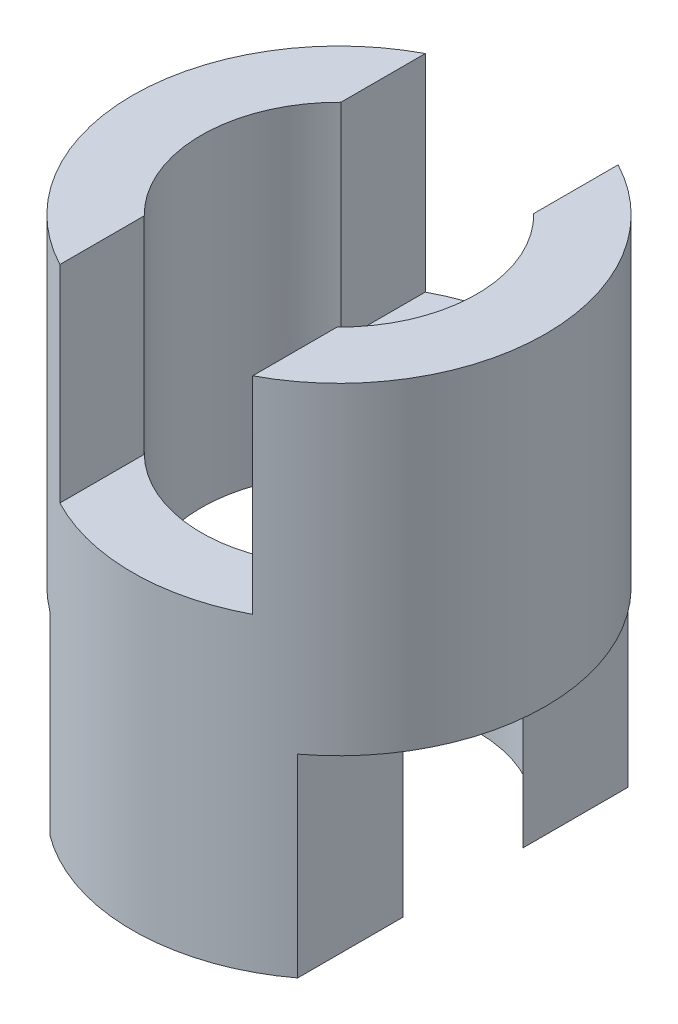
ISO-10303-21;
HEADER;
FILE_DESCRIPTION(('STEP AP214'),'2;1');
FILE_NAME('part.step','',(''),(''),'','','');
FILE_SCHEMA(('AUTOMOTIVE_DESIGN { 1 0 10303 214 1 1 1 1 }'));
ENDSEC;
DATA;
#1=APPLICATION_CONTEXT('core data for automotive mechanical design processes');
#2=APPLICATION_PROTOCOL_DEFINITION('international standard','automotive_design',2000,#1);
#3=PRODUCT_CONTEXT('',#1,'mechanical');
#4=PRODUCT('Part','Part','',(#3));
#5=PRODUCT_RELATED_PRODUCT_CATEGORY('part','',(#4));
#6=PRODUCT_DEFINITION_FORMATION('','',#4);
#7=PRODUCT_DEFINITION_CONTEXT('part definition',#1,'design');
#8=PRODUCT_DEFINITION('design','',#6,#7);
#9=PRODUCT_DEFINITION_SHAPE('','',#8);
#10=(LENGTH_UNIT() NAMED_UNIT(*) SI_UNIT(.MILLI.,.METRE.));
#11=(NAMED_UNIT(*) PLANE_ANGLE_UNIT() SI_UNIT($,.RADIAN.));
#12=(NAMED_UNIT(*) SI_UNIT($,.STERADIAN.) SOLID_ANGLE_UNIT());
#13=UNCERTAINTY_MEASURE_WITH_UNIT(LENGTH_MEASURE(1.E-05),#10,'distance_accuracy_value','');
#14=(GEOMETRIC_REPRESENTATION_CONTEXT(3) GLOBAL_UNCERTAINTY_ASSIGNED_CONTEXT((#13)) GLOBAL_UNIT_ASSIGNED_CONTEXT((#10,
#11,#12)) REPRESENTATION_CONTEXT('',''));
#15=CARTESIAN_POINT('',(0.,0.,0.));
#16=DIRECTION('',(0.,0.,1.));
#17=DIRECTION('',(1.,0.,0.));
#18=AXIS2_PLACEMENT_3D('',#15,#16,#17);
#19=CARTESIAN_POINT('',(0.,0.,0.));
#20=DIRECTION('',(0.,1.,0.));
#21=DIRECTION('',(0.,0.,1.));
#22=AXIS2_PLACEMENT_3D('',#19,#20,#21);
#23=PLANE('',#22);
#24=CARTESIAN_POINT('',(0.,0.,0.));
#25=DIRECTION('',(0.,1.,0.));
#26=DIRECTION('',(0.,0.,1.));
#27=AXIS2_PLACEMENT_3D('',#24,#25,#26);
#28=CIRCLE('',#27,30.);
#29=CARTESIAN_POINT('',(18.,0.,-24.));
#30=VERTEX_POINT('',#29);
#31=CARTESIAN_POINT('',(-18.,0.,-24.));
#32=VERTEX_POINT('',#31);
#33=EDGE_CURVE('E221',#30,#32,#28,.T.);
#34=ORIENTED_EDGE('',*,*,#33,.F.);
#35=DIRECTION('',(0.,0.,1.));
#36=VECTOR('',#35,1.);
#37=CARTESIAN_POINT('',(18.,0.,0.));
#38=LINE('',#37,#36);
#39=CARTESIAN_POINT('',(18.,0.,-8.71779788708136));
#40=VERTEX_POINT('',#39);
#41=EDGE_CURVE('E150',#30,#40,#38,.T.);
#42=ORIENTED_EDGE('',*,*,#41,.T.);
#43=CARTESIAN_POINT('',(0.,0.,0.));
#44=DIRECTION('',(0.,-1.,0.));
#45=DIRECTION('',(0.,0.,-1.));
#46=AXIS2_PLACEMENT_3D('',#43,#44,#45);
#47=CIRCLE('',#46,20.);
#48=CARTESIAN_POINT('',(-18.,0.,-8.71779788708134));
#49=VERTEX_POINT('',#48);
#50=EDGE_CURVE('E190',#49,#40,#47,.T.);
#51=ORIENTED_EDGE('',*,*,#50,.F.);
#52=DIRECTION('',(0.,0.,-1.));
#53=VECTOR('',#52,1.);
#54=CARTESIAN_POINT('',(-18.,0.,0.));
#55=LINE('',#54,#53);
#56=EDGE_CURVE('E54',#49,#32,#55,.T.);
#57=ORIENTED_EDGE('',*,*,#56,.T.);
#58=EDGE_LOOP('',(#34,#42,#51,#57));
#59=FACE_BOUND('',#58,.T.);
#60=ADVANCED_FACE('F31',(#59),#23,.F.);
#61=CARTESIAN_POINT('',(-14.,45.,52.1788235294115));
#62=DIRECTION('',(0.,1.,0.));
#63=DIRECTION('',(0.,0.,1.));
#64=AXIS2_PLACEMENT_3D('',#61,#62,#63);
#65=PLANE('',#64);
#66=CARTESIAN_POINT('',(0.,45.,0.));
#67=DIRECTION('',(0.,1.,0.));
#68=DIRECTION('',(0.,0.,1.));
#69=AXIS2_PLACEMENT_3D('',#66,#67,#68);
#70=CIRCLE('',#69,20.);
#71=CARTESIAN_POINT('',(14.,45.,-14.2828568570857));
#72=VERTEX_POINT('',#71);
#73=CARTESIAN_POINT('',(-14.,45.,-14.2828568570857));
#74=VERTEX_POINT('',#73);
#75=EDGE_CURVE('E188',#72,#74,#70,.T.);
#76=ORIENTED_EDGE('',*,*,#75,.F.);
#77=DIRECTION('',(0.,0.,-1.));
#78=VECTOR('',#77,1.);
#79=CARTESIAN_POINT('',(14.,45.,-47.2950912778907));
#80=LINE('',#79,#78);
#81=CARTESIAN_POINT('',(14.,45.,-26.5329983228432));
#82=VERTEX_POINT('',#81);
#83=EDGE_CURVE('E205',#72,#82,#80,.T.);
#84=ORIENTED_EDGE('',*,*,#83,.T.);
#85=CARTESIAN_POINT('',(0.,45.,0.));
#86=DIRECTION('',(0.,1.,0.));
#87=DIRECTION('',(0.,0.,1.));
#88=AXIS2_PLACEMENT_3D('',#85,#86,#87);
#89=CIRCLE('',#88,30.);
#90=CARTESIAN_POINT('',(-14.,45.,-26.5329983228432));
#91=VERTEX_POINT('',#90);
#92=EDGE_CURVE('E238',#82,#91,#89,.T.);
#93=ORIENTED_EDGE('',*,*,#92,.T.);
#94=DIRECTION('',(0.,0.,1.));
#95=VECTOR('',#94,1.);
#96=CARTESIAN_POINT('',(-14.,45.,-47.2950912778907));
#97=LINE('',#96,#95);
#98=EDGE_CURVE('E202',#91,#74,#97,.T.);
#99=ORIENTED_EDGE('',*,*,#98,.T.);
#100=EDGE_LOOP('',(#76,#84,#93,#99));
#101=FACE_BOUND('',#100,.T.);
#102=ADVANCED_FACE('F275',(#101),#65,.T.);
#103=CARTESIAN_POINT('',(-14.,45.,-47.2950912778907));
#104=DIRECTION('',(-1.,0.,0.));
#105=DIRECTION('',(0.,0.,1.));
#106=AXIS2_PLACEMENT_3D('',#103,#104,#105);
#107=PLANE('',#106);
#108=DIRECTION('',(0.,0.,1.));
#109=VECTOR('',#108,1.);
#110=CARTESIAN_POINT('',(-14.,75.,0.));
#111=LINE('',#110,#109);
#112=CARTESIAN_POINT('',(-14.,75.,-26.5329983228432));
#113=VERTEX_POINT('',#112);
#114=CARTESIAN_POINT('',(-14.,75.,-14.2828568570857));
#115=VERTEX_POINT('',#114);
#116=EDGE_CURVE('E233',#113,#115,#111,.T.);
#117=ORIENTED_EDGE('',*,*,#116,.T.);
#118=DIRECTION('',(0.,-1.,0.));
#119=VECTOR('',#118,1.);
#120=CARTESIAN_POINT('',(-14.,75.,-14.2828568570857));
#121=LINE('',#120,#119);
#122=EDGE_CURVE('E194',#115,#74,#121,.T.);
#123=ORIENTED_EDGE('',*,*,#122,.T.);
#124=ORIENTED_EDGE('',*,*,#98,.F.);
#125=DIRECTION('',(0.,-1.,0.));
#126=VECTOR('',#125,1.);
#127=CARTESIAN_POINT('',(-14.,75.,-26.5329983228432));
#128=LINE('',#127,#126);
#129=EDGE_CURVE('E218',#113,#91,#128,.T.);
#130=ORIENTED_EDGE('',*,*,#129,.F.);
#131=EDGE_LOOP('',(#117,#123,#124,#130));
#132=FACE_BOUND('',#131,.T.);
#133=ADVANCED_FACE('F279',(#132),#107,.F.);
#134=CARTESIAN_POINT('',(14.,45.,-47.2950912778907));
#135=DIRECTION('',(1.,0.,0.));
#136=DIRECTION('',(0.,0.,-1.));
#137=AXIS2_PLACEMENT_3D('',#134,#135,#136);
#138=PLANE('',#137);
#139=DIRECTION('',(0.,0.,-1.));
#140=VECTOR('',#139,1.);
#141=CARTESIAN_POINT('',(14.,75.,0.));
#142=LINE('',#141,#140);
#143=CARTESIAN_POINT('',(14.,75.,26.5329983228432));
#144=VERTEX_POINT('',#143);
#145=CARTESIAN_POINT('',(14.,75.,14.2828568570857));
#146=VERTEX_POINT('',#145);
#147=EDGE_CURVE('E229',#144,#146,#142,.T.);
#148=ORIENTED_EDGE('',*,*,#147,.T.);
#149=DIRECTION('',(0.,-1.,0.));
#150=VECTOR('',#149,1.);
#151=CARTESIAN_POINT('',(14.,75.,14.2828568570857));
#152=LINE('',#151,#150);
#153=CARTESIAN_POINT('',(14.,45.,14.2828568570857));
#154=VERTEX_POINT('',#153);
#155=EDGE_CURVE('E242',#146,#154,#152,.T.);
#156=ORIENTED_EDGE('',*,*,#155,.T.);
#157=CARTESIAN_POINT('',(14.,45.,26.5329983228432));
#158=VERTEX_POINT('',#157);
#159=EDGE_CURVE('E206',#158,#154,#80,.T.);
#160=ORIENTED_EDGE('',*,*,#159,.F.);
#161=DIRECTION('',(0.,-1.,0.));
#162=VECTOR('',#161,1.);
#163=CARTESIAN_POINT('',(14.,75.,26.5329983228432));
#164=LINE('',#163,#162);
#165=EDGE_CURVE('E212',#144,#158,#164,.T.);
#166=ORIENTED_EDGE('',*,*,#165,.F.);
#167=EDGE_LOOP('',(#148,#156,#160,#166));
#168=FACE_BOUND('',#167,.T.);
#169=ADVANCED_FACE('F300',(#168),#138,.F.);
#170=CARTESIAN_POINT('',(0.,75.,0.));
#171=DIRECTION('',(0.,1.,0.));
#172=DIRECTION('',(0.,0.,1.));
#173=AXIS2_PLACEMENT_3D('',#170,#171,#172);
#174=PLANE('',#173);
#175=CARTESIAN_POINT('',(0.,75.,0.));
#176=DIRECTION('',(0.,-1.,0.));
#177=DIRECTION('',(0.,0.,-1.));
#178=AXIS2_PLACEMENT_3D('',#175,#176,#177);
#179=CIRCLE('',#178,20.);
#180=CARTESIAN_POINT('',(-14.,75.,14.2828568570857));
#181=VERTEX_POINT('',#180);
#182=EDGE_CURVE('E189',#181,#115,#179,.T.);
#183=ORIENTED_EDGE('',*,*,#182,.T.);
#184=ORIENTED_EDGE('',*,*,#116,.F.);
#185=CARTESIAN_POINT('',(0.,75.,0.));
#186=DIRECTION('',(0.,1.,0.));
#187=DIRECTION('',(0.,0.,1.));
#188=AXIS2_PLACEMENT_3D('',#185,#186,#187);
#189=CIRCLE('',#188,30.);
#190=CARTESIAN_POINT('',(-14.,75.,26.5329983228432));
#191=VERTEX_POINT('',#190);
#192=EDGE_CURVE('E226',#113,#191,#189,.T.);
#193=ORIENTED_EDGE('',*,*,#192,.T.);
#194=EDGE_CURVE('E232',#181,#191,#111,.T.);
#195=ORIENTED_EDGE('',*,*,#194,.F.);
#196=EDGE_LOOP('',(#183,#184,#193,#195));
#197=FACE_BOUND('',#196,.T.);
#198=ADVANCED_FACE('F293',(#197),#174,.T.);
#199=CARTESIAN_POINT('',(0.,75.,0.));
#200=DIRECTION('',(0.,-1.,0.));
#201=DIRECTION('',(0.,0.,-1.));
#202=AXIS2_PLACEMENT_3D('',#199,#200,#201);
#203=CYLINDRICAL_SURFACE('',#202,30.);
#204=ORIENTED_EDGE('',*,*,#192,.F.);
#205=ORIENTED_EDGE('',*,*,#129,.T.);
#206=ORIENTED_EDGE('',*,*,#92,.F.);
#207=DIRECTION('',(0.,-1.,0.));
#208=VECTOR('',#207,1.);
#209=CARTESIAN_POINT('',(14.,75.,-26.5329983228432));
#210=LINE('',#209,#208);
#211=CARTESIAN_POINT('',(14.,75.,-26.5329983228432));
#212=VERTEX_POINT('',#211);
#213=EDGE_CURVE('E209',#82,#212,#210,.F.);
#214=ORIENTED_EDGE('',*,*,#213,.T.);
#215=EDGE_CURVE('E222',#144,#212,#189,.T.);
#216=ORIENTED_EDGE('',*,*,#215,.F.);
#217=ORIENTED_EDGE('',*,*,#165,.T.);
#218=CARTESIAN_POINT('',(-14.,45.,26.5329983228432));
#219=VERTEX_POINT('',#218);
#220=EDGE_CURVE('E236',#219,#158,#89,.T.);
#221=ORIENTED_EDGE('',*,*,#220,.F.);
#222=DIRECTION('',(0.,-1.,0.));
#223=VECTOR('',#222,1.);
#224=CARTESIAN_POINT('',(-14.,75.,26.5329983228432));
#225=LINE('',#224,#223);
#226=EDGE_CURVE('E215',#219,#191,#225,.F.);
#227=ORIENTED_EDGE('',*,*,#226,.T.);
#228=EDGE_LOOP('',(#204,#205,#206,#214,#216,#217,#221,#227));
#229=FACE_BOUND('',#228,.T.);
#230=CARTESIAN_POINT('',(0.,28.1586578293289,0.));
#231=DIRECTION('',(0.,1.,0.));
#232=DIRECTION('',(-1.,0.,0.));
#233=AXIS2_PLACEMENT_3D('',#230,#231,#232);
#234=CIRCLE('',#233,30.);
#235=CARTESIAN_POINT('',(18.,28.1586578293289,24.));
#236=VERTEX_POINT('',#235);
#237=CARTESIAN_POINT('',(18.,28.1586578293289,-24.));
#238=VERTEX_POINT('',#237);
#239=EDGE_CURVE('E157',#236,#238,#234,.T.);
#240=ORIENTED_EDGE('',*,*,#239,.T.);
#241=DIRECTION('',(0.,-1.,0.));
#242=VECTOR('',#241,1.);
#243=CARTESIAN_POINT('',(18.,75.,-24.));
#244=LINE('',#243,#242);
#245=EDGE_CURVE('E145',#238,#30,#244,.T.);
#246=ORIENTED_EDGE('',*,*,#245,.T.);
#247=ORIENTED_EDGE('',*,*,#33,.T.);
#248=DIRECTION('',(0.,-1.,0.));
#249=VECTOR('',#248,1.);
#250=CARTESIAN_POINT('',(-18.,75.,-24.));
#251=LINE('',#250,#249);
#252=CARTESIAN_POINT('',(-18.,28.1586578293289,-24.));
#253=VERTEX_POINT('',#252);
#254=EDGE_CURVE('E174',#32,#253,#251,.F.);
#255=ORIENTED_EDGE('',*,*,#254,.T.);
#256=CARTESIAN_POINT('',(0.,28.1586578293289,0.));
#257=DIRECTION('',(0.,1.,0.));
#258=DIRECTION('',(0.,0.,1.));
#259=AXIS2_PLACEMENT_3D('',#256,#257,#258);
#260=CIRCLE('',#259,30.);
#261=CARTESIAN_POINT('',(-18.,28.1586578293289,24.));
#262=VERTEX_POINT('',#261);
#263=EDGE_CURVE('E181',#253,#262,#260,.T.);
#264=ORIENTED_EDGE('',*,*,#263,.T.);
#265=DIRECTION('',(0.,-1.,0.));
#266=VECTOR('',#265,1.);
#267=CARTESIAN_POINT('',(-18.,75.,24.));
#268=LINE('',#267,#266);
#269=CARTESIAN_POINT('',(-18.,0.,24.));
#270=VERTEX_POINT('',#269);
#271=EDGE_CURVE('E178',#262,#270,#268,.T.);
#272=ORIENTED_EDGE('',*,*,#271,.T.);
#273=CARTESIAN_POINT('',(18.,0.,24.));
#274=VERTEX_POINT('',#273);
#275=EDGE_CURVE('E227',#270,#274,#28,.T.);
#276=ORIENTED_EDGE('',*,*,#275,.T.);
#277=DIRECTION('',(0.,-1.,0.));
#278=VECTOR('',#277,1.);
#279=CARTESIAN_POINT('',(18.,75.,24.));
#280=LINE('',#279,#278);
#281=EDGE_CURVE('E163',#274,#236,#280,.F.);
#282=ORIENTED_EDGE('',*,*,#281,.T.);
#283=EDGE_LOOP('',(#240,#246,#247,#255,#264,#272,#276,#282));
#284=FACE_BOUND('',#283,.T.);
#285=ADVANCED_FACE('F33',(#229,#284),#203,.T.);
#286=CARTESIAN_POINT('',(14.,75.,-14.2828568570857));
#287=VERTEX_POINT('',#286);
#288=EDGE_CURVE('E185',#287,#146,#179,.T.);
#289=ORIENTED_EDGE('',*,*,#288,.T.);
#290=ORIENTED_EDGE('',*,*,#147,.F.);
#291=ORIENTED_EDGE('',*,*,#215,.T.);
#292=EDGE_CURVE('E225',#287,#212,#142,.T.);
#293=ORIENTED_EDGE('',*,*,#292,.F.);
#294=EDGE_LOOP('',(#289,#290,#291,#293));
#295=FACE_BOUND('',#294,.T.);
#296=ADVANCED_FACE('F285',(#295),#174,.T.);
#297=CARTESIAN_POINT('',(18.,0.,8.71779788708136));
#298=VERTEX_POINT('',#297);
#299=CARTESIAN_POINT('',(-18.,0.,8.71779788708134));
#300=VERTEX_POINT('',#299);
#301=EDGE_CURVE('E184',#298,#300,#47,.T.);
#302=ORIENTED_EDGE('',*,*,#301,.F.);
#303=EDGE_CURVE('E164',#298,#274,#38,.T.);
#304=ORIENTED_EDGE('',*,*,#303,.T.);
#305=ORIENTED_EDGE('',*,*,#275,.F.);
#306=EDGE_CURVE('E175',#270,#300,#55,.T.);
#307=ORIENTED_EDGE('',*,*,#306,.T.);
#308=EDGE_LOOP('',(#302,#304,#305,#307));
#309=FACE_BOUND('',#308,.T.);
#310=ADVANCED_FACE('F262',(#309),#23,.F.);
#311=CARTESIAN_POINT('',(-14.,45.,14.2828568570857));
#312=VERTEX_POINT('',#311);
#313=EDGE_CURVE('E195',#312,#154,#70,.T.);
#314=ORIENTED_EDGE('',*,*,#313,.F.);
#315=EDGE_CURVE('E201',#312,#219,#97,.T.);
#316=ORIENTED_EDGE('',*,*,#315,.T.);
#317=ORIENTED_EDGE('',*,*,#220,.T.);
#318=ORIENTED_EDGE('',*,*,#159,.T.);
#319=EDGE_LOOP('',(#314,#316,#317,#318));
#320=FACE_BOUND('',#319,.T.);
#321=ADVANCED_FACE('F282',(#320),#65,.T.);
#322=ORIENTED_EDGE('',*,*,#315,.F.);
#323=DIRECTION('',(0.,-1.,0.));
#324=VECTOR('',#323,1.);
#325=CARTESIAN_POINT('',(-14.,75.,14.2828568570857));
#326=LINE('',#325,#324);
#327=EDGE_CURVE('E198',#312,#181,#326,.F.);
#328=ORIENTED_EDGE('',*,*,#327,.T.);
#329=ORIENTED_EDGE('',*,*,#194,.T.);
#330=ORIENTED_EDGE('',*,*,#226,.F.);
#331=EDGE_LOOP('',(#322,#328,#329,#330));
#332=FACE_BOUND('',#331,.T.);
#333=ADVANCED_FACE('F290',(#332),#107,.F.);
#334=ORIENTED_EDGE('',*,*,#83,.F.);
#335=DIRECTION('',(0.,-1.,0.));
#336=VECTOR('',#335,1.);
#337=CARTESIAN_POINT('',(14.,75.,-14.2828568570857));
#338=LINE('',#337,#336);
#339=EDGE_CURVE('E239',#72,#287,#338,.F.);
#340=ORIENTED_EDGE('',*,*,#339,.T.);
#341=ORIENTED_EDGE('',*,*,#292,.T.);
#342=ORIENTED_EDGE('',*,*,#213,.F.);
#343=EDGE_LOOP('',(#334,#340,#341,#342));
#344=FACE_BOUND('',#343,.T.);
#345=ADVANCED_FACE('F307',(#344),#138,.F.);
#346=CARTESIAN_POINT('',(0.,75.,0.));
#347=DIRECTION('',(0.,-1.,0.));
#348=DIRECTION('',(0.,0.,-1.));
#349=AXIS2_PLACEMENT_3D('',#346,#347,#348);
#350=CYLINDRICAL_SURFACE('',#349,20.);
#351=ORIENTED_EDGE('',*,*,#50,.T.);
#352=DIRECTION('',(0.,-1.,0.));
#353=VECTOR('',#352,1.);
#354=CARTESIAN_POINT('',(18.,75.,-8.71779788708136));
#355=LINE('',#354,#353);
#356=CARTESIAN_POINT('',(18.,28.1586578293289,-8.71779788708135));
#357=VERTEX_POINT('',#356);
#358=EDGE_CURVE('E11',#40,#357,#355,.F.);
#359=ORIENTED_EDGE('',*,*,#358,.T.);
#360=CARTESIAN_POINT('',(0.,28.1586578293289,0.));
#361=DIRECTION('',(0.,1.,0.));
#362=DIRECTION('',(-1.,0.,0.));
#363=AXIS2_PLACEMENT_3D('',#360,#361,#362);
#364=CIRCLE('',#363,20.);
#365=CARTESIAN_POINT('',(18.,28.1586578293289,8.71779788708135));
#366=VERTEX_POINT('',#365);
#367=EDGE_CURVE('E159',#357,#366,#364,.F.);
#368=ORIENTED_EDGE('',*,*,#367,.T.);
#369=DIRECTION('',(0.,-1.,0.));
#370=VECTOR('',#369,1.);
#371=CARTESIAN_POINT('',(18.,75.,8.71779788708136));
#372=LINE('',#371,#370);
#373=EDGE_CURVE('E39',#366,#298,#372,.T.);
#374=ORIENTED_EDGE('',*,*,#373,.T.);
#375=ORIENTED_EDGE('',*,*,#301,.T.);
#376=DIRECTION('',(0.,-1.,0.));
#377=VECTOR('',#376,1.);
#378=CARTESIAN_POINT('',(-18.,75.,8.71779788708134));
#379=LINE('',#378,#377);
#380=CARTESIAN_POINT('',(-18.,28.1586578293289,8.71779788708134));
#381=VERTEX_POINT('',#380);
#382=EDGE_CURVE('E250',#300,#381,#379,.F.);
#383=ORIENTED_EDGE('',*,*,#382,.T.);
#384=CARTESIAN_POINT('',(0.,28.1586578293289,0.));
#385=DIRECTION('',(0.,1.,0.));
#386=DIRECTION('',(0.,0.,1.));
#387=AXIS2_PLACEMENT_3D('',#384,#385,#386);
#388=CIRCLE('',#387,20.);
#389=CARTESIAN_POINT('',(-18.,28.1586578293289,-8.71779788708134));
#390=VERTEX_POINT('',#389);
#391=EDGE_CURVE('E247',#381,#390,#388,.F.);
#392=ORIENTED_EDGE('',*,*,#391,.T.);
#393=DIRECTION('',(0.,-1.,0.));
#394=VECTOR('',#393,1.);
#395=CARTESIAN_POINT('',(-18.,75.,-8.71779788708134));
#396=LINE('',#395,#394);
#397=EDGE_CURVE('E245',#390,#49,#396,.T.);
#398=ORIENTED_EDGE('',*,*,#397,.T.);
#399=EDGE_LOOP('',(#351,#359,#368,#374,#375,#383,#392,#398));
#400=FACE_BOUND('',#399,.T.);
#401=ORIENTED_EDGE('',*,*,#313,.T.);
#402=ORIENTED_EDGE('',*,*,#155,.F.);
#403=ORIENTED_EDGE('',*,*,#288,.F.);
#404=ORIENTED_EDGE('',*,*,#339,.F.);
#405=ORIENTED_EDGE('',*,*,#75,.T.);
#406=ORIENTED_EDGE('',*,*,#122,.F.);
#407=ORIENTED_EDGE('',*,*,#182,.F.);
#408=ORIENTED_EDGE('',*,*,#327,.F.);
#409=EDGE_LOOP('',(#401,#402,#403,#404,#405,#406,#407,#408));
#410=FACE_BOUND('',#409,.T.);
#411=ADVANCED_FACE('F256',(#400,#410),#350,.F.);
#412=CARTESIAN_POINT('',(-36.9864678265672,28.1586578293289,-30.));
#413=DIRECTION('',(0.,1.,0.));
#414=DIRECTION('',(0.,0.,1.));
#415=AXIS2_PLACEMENT_3D('',#412,#413,#414);
#416=PLANE('',#415);
#417=DIRECTION('',(0.,0.,1.));
#418=VECTOR('',#417,1.);
#419=CARTESIAN_POINT('',(-18.,28.1586578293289,-30.));
#420=LINE('',#419,#418);
#421=EDGE_CURVE('E172',#253,#390,#420,.T.);
#422=ORIENTED_EDGE('',*,*,#421,.T.);
#423=ORIENTED_EDGE('',*,*,#391,.F.);
#424=EDGE_CURVE('E154',#381,#262,#420,.T.);
#425=ORIENTED_EDGE('',*,*,#424,.T.);
#426=ORIENTED_EDGE('',*,*,#263,.F.);
#427=EDGE_LOOP('',(#422,#423,#425,#426));
#428=FACE_BOUND('',#427,.T.);
#429=ADVANCED_FACE('F270',(#428),#416,.F.);
#430=CARTESIAN_POINT('',(-18.,28.1586578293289,-30.));
#431=DIRECTION('',(1.,0.,0.));
#432=DIRECTION('',(0.,1.,0.));
#433=AXIS2_PLACEMENT_3D('',#430,#431,#432);
#434=PLANE('',#433);
#435=ORIENTED_EDGE('',*,*,#424,.F.);
#436=ORIENTED_EDGE('',*,*,#382,.F.);
#437=ORIENTED_EDGE('',*,*,#306,.F.);
#438=ORIENTED_EDGE('',*,*,#271,.F.);
#439=EDGE_LOOP('',(#435,#436,#437,#438));
#440=FACE_BOUND('',#439,.T.);
#441=ADVANCED_FACE('F266',(#440),#434,.F.);
#442=ORIENTED_EDGE('',*,*,#56,.F.);
#443=ORIENTED_EDGE('',*,*,#397,.F.);
#444=ORIENTED_EDGE('',*,*,#421,.F.);
#445=ORIENTED_EDGE('',*,*,#254,.F.);
#446=EDGE_LOOP('',(#442,#443,#444,#445));
#447=FACE_BOUND('',#446,.T.);
#448=ADVANCED_FACE('F271',(#447),#434,.F.);
#449=CARTESIAN_POINT('',(18.,28.1586578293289,-30.));
#450=DIRECTION('',(-1.,0.,0.));
#451=DIRECTION('',(0.,-1.,0.));
#452=AXIS2_PLACEMENT_3D('',#449,#450,#451);
#453=PLANE('',#452);
#454=DIRECTION('',(0.,0.,1.));
#455=VECTOR('',#454,1.);
#456=CARTESIAN_POINT('',(18.,28.1586578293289,-30.));
#457=LINE('',#456,#455);
#458=EDGE_CURVE('E148',#238,#357,#457,.T.);
#459=ORIENTED_EDGE('',*,*,#458,.T.);
#460=ORIENTED_EDGE('',*,*,#358,.F.);
#461=ORIENTED_EDGE('',*,*,#41,.F.);
#462=ORIENTED_EDGE('',*,*,#245,.F.);
#463=EDGE_LOOP('',(#459,#460,#461,#462));
#464=FACE_BOUND('',#463,.T.);
#465=ADVANCED_FACE('F147',(#464),#453,.F.);
#466=ORIENTED_EDGE('',*,*,#303,.F.);
#467=ORIENTED_EDGE('',*,*,#373,.F.);
#468=EDGE_CURVE('E46',#366,#236,#457,.T.);
#469=ORIENTED_EDGE('',*,*,#468,.T.);
#470=ORIENTED_EDGE('',*,*,#281,.F.);
#471=EDGE_LOOP('',(#466,#467,#469,#470));
#472=FACE_BOUND('',#471,.T.);
#473=ADVANCED_FACE('F342',(#472),#453,.F.);
#474=CARTESIAN_POINT('',(31.2145816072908,28.1586578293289,-30.));
#475=DIRECTION('',(0.,1.,0.));
#476=DIRECTION('',(-1.,0.,0.));
#477=AXIS2_PLACEMENT_3D('',#474,#475,#476);
#478=PLANE('',#477);
#479=ORIENTED_EDGE('',*,*,#468,.F.);
#480=ORIENTED_EDGE('',*,*,#367,.F.);
#481=ORIENTED_EDGE('',*,*,#458,.F.);
#482=ORIENTED_EDGE('',*,*,#239,.F.);
#483=EDGE_LOOP('',(#479,#480,#481,#482));
#484=FACE_BOUND('',#483,.T.);
#485=ADVANCED_FACE('F156',(#484),#478,.F.);
#486=CLOSED_SHELL('',(#60,#102,#133,#169,#198,#285,#296,#310,#321,#333,#345,#411,#429,#441,#448,
#465,#473,#485));
#487=MANIFOLD_SOLID_BREP('B2',#486);
#488=ADVANCED_BREP_SHAPE_REPRESENTATION('',(#18,#487),#14);
#489=SHAPE_DEFINITION_REPRESENTATION(#9,#488);
ENDSEC;
END-ISO-10303-21;
